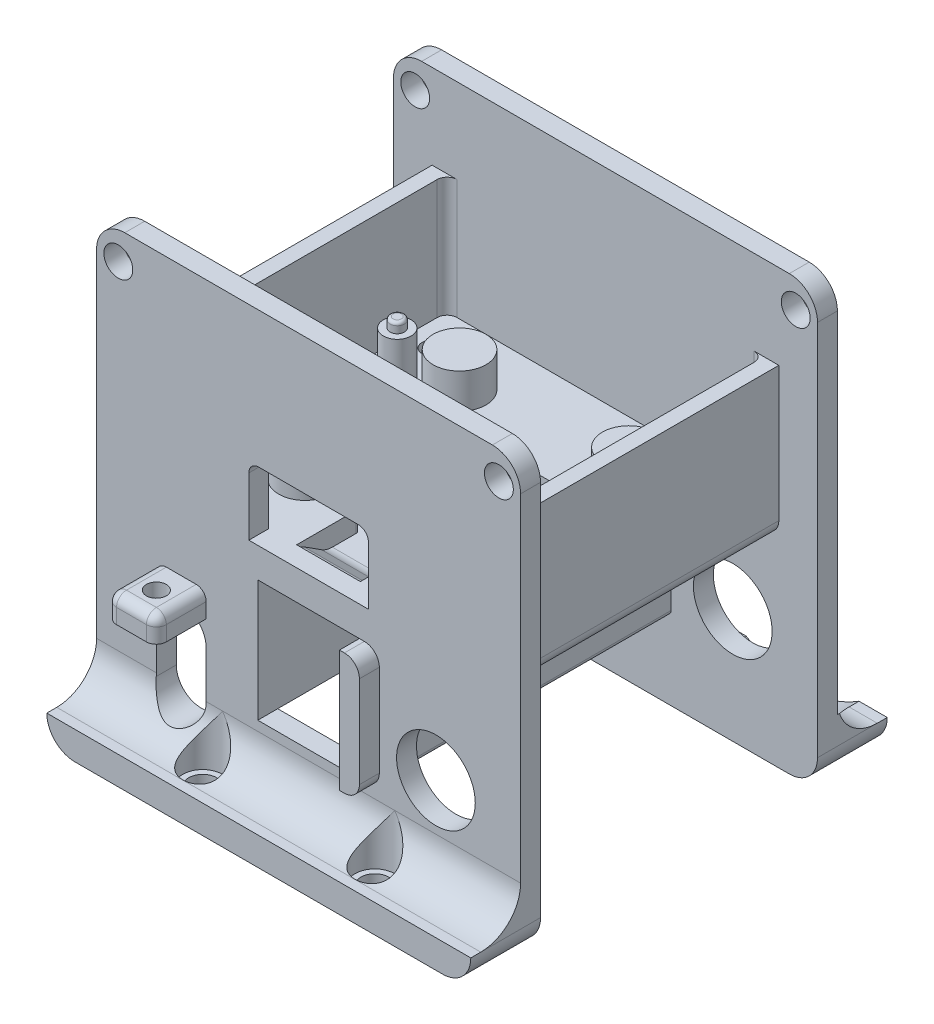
from build123d import *

# Parameters (mm, degrees)
SKETCH_1_W                = 31.8
SKETCH_1_H                = 27.8
EXTRUDE_1_DEPTH           = 3
EXTRUDE_2_DEPTH           = 1.5
SKETCH_5_R                = 1.4
EXTRUDE_3_DEPTH           = 4.5
SKETCH_6_R                = 0.725
EXTRUDE_4_DEPTH           = 1
SKETCH_7_R                = 1
CUT_EXTRUDE_1_DEPTH       = 10
SKETCH_8_R                = 2
CUT_EXTRUDE_2_DEPTH       = 1
FILLET_1_R                = 1
SKETCH_9_R                = 2.65
EXTRUDE_5_DEPTH           = 3.5
FILLET_2_R                = 0.3
CUT_EXTRUDE_8_DEPTH       = 2
CUT_EXTRUDE_9_DEPTH       = 1.5
EXTRUDE_6_DEPTH           = 6.4
FILLET_3_R                = 2
FILLET_5_R                = 1
FILLET_6_R                = 0.4
EXTRUDE_START             = -15
SKETCH_21_W               = 34.8
SKETCH_21_H               = 31.8
EXTRUDE_7_DEPTH           = 15
SKETCH_22_R               = 1.45
EXTRUDE_8_DEPTH           = 2
EXTRUDE_START_2           = -2
SKETCH_24_R               = 1.45
EXTRUDE_9_DEPTH           = 2
CUT_EXTRUDE_10_DEPTH      = 2
EXTRUDE_10_DEPTH          = 29.8
SKETCH_35_W               = 10.2
SKETCH_35_H               = 12.2
CUT_EXTRUDE_14_DEPTH      = 45.903545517
EXTRUDE_START_3           = 5
EXTRUDE_14_DEPTH          = 5
EXTRUDE_15_DEPTH          = 42.56
EXTRUDE_16_DEPTH          = 5
EXTRUDE_17_DEPTH          = 42.56
CUT_EXTRUDE_15_DEPTH      = 49.572918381
CUT_EXTRUDE_15_DEPTH_BACK = 49.572918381
SKETCH_36_R               = 3.95
SKETCH_37_W               = 5
SKETCH_37_H               = 2.5
EXTRUDE_11_DEPTH          = 5
SKETCH_38_W               = 5
SKETCH_38_H               = 2.5
EXTRUDE_12_DEPTH          = 5
FILLET_7_R                = 1
FILLET_8_R                = 1
EXTRUDE_13_DEPTH          = 2
SKETCH_49_R               = 1.4
CUT_EXTRUDE_17_DEPTH      = 6
SKETCH_51_R               = 10.376352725
CUT_EXTRUDE_18_DEPTH      = 6
SKETCH_52_R               = 1.99
CUT_EXTRUDE_19_DEPTH      = 1.5
CUT_EXTRUDE_START         = 4
SKETCH_52_2_R             = 1.99
CUT_EXTRUDE_20_DEPTH      = 4
FILLET_10_R               = 1
FILLET_12_R               = 1
SKETCH_42_R               = 1
CUT_EXTRUDE_21_DEPTH      = 4
SKETCH_54_W               = 10.2
SKETCH_54_H               = 12.2
SKETCH_54_R               = 0.8
SKETCH_54_R_2             = 1.8
EXTRUDE_18_DEPTH          = 2
FILLET_13_R               = 1.5


with BuildPart() as part:
    # Sketch 1 → Extrude 1 (new body)
    with BuildSketch(Plane(origin=(0, 0, 0), x_dir=(1, 0, 0), z_dir=(0, 1, 0))):
        Rectangle(SKETCH_1_W, SKETCH_1_H)
    extrude(amount=EXTRUDE_1_DEPTH)

    # Sketch 2 → Extrude 2 (add)
    with BuildSketch(Plane(origin=(0, 3, 0), x_dir=(1, 0, 0), z_dir=(0, 1, 0))):
        Polygon((-5.35, 5.35), (5.35, 5.35), (5.35, -7.55), (4.35, -7.55), (4.35, 4.35), (-4.35, 4.35), (-4.35, -7.55), (-5.35, -7.55), align=None)
    extrude(amount=EXTRUDE_2_DEPTH)

    # Sketch 5 → Extrude 3 (add)
    with BuildSketch(Plane(origin=(0, 3, 0), x_dir=(1, 0, 0), z_dir=(0, 1, 0))):
        with Locations(Location((12.5, 5.5, 0), (0, 0, 270))):
            Circle(SKETCH_5_R)
        with Locations(Location((12.5, -5.5, 0), (0, 0, 90))):
            Circle(SKETCH_5_R)
        with Locations(Location((-12.5, -5.5, 0), (0, 0, 270))):
            Circle(SKETCH_5_R)
        with Locations(Location((-12.5, 5.5, 0), (0, 0, 90))):
            Circle(SKETCH_5_R)
    extrude(amount=EXTRUDE_3_DEPTH)

    # Sketch 6 → Extrude 4 (add)
    with BuildSketch(Plane(origin=(0, 7.5, 0), x_dir=(1, 0, 0), z_dir=(0, 1, 0))):
        with Locations(Location((-12.5, -5.5, 0), (0, 0, 270))):
            Circle(SKETCH_6_R)
        with Locations(Location((-12.5, 5.5, 0), (0, 0, 270))):
            Circle(SKETCH_6_R)
        with Locations(Location((12.5, 5.5, 0), (0, 0, 270))):
            Circle(SKETCH_6_R)
        with Locations(Location((12.5, -5.5, 0), (0, 0, 270))):
            Circle(SKETCH_6_R)
    extrude(amount=EXTRUDE_4_DEPTH)

    # Sketch 7 → Cut-Extrude 1 (cut)
    with BuildSketch(Plane(origin=(0, 3, 0), x_dir=(1, 0, 0), z_dir=(0, 1, 0))):
        with Locations(Location((13.5, 10, 0), (0, 0, 270))):
            Circle(SKETCH_7_R)
        with Locations(Location((-13.5, 10, 0), (0, 0, 270))):
            Circle(SKETCH_7_R)
        with Locations(Location((-13.5, -10, 0), (0, 0, 270))):
            Circle(SKETCH_7_R)
        with Locations(Location((13.5, -10, 0), (0, 0, 270))):
            Circle(SKETCH_7_R)
    extrude(amount=-CUT_EXTRUDE_1_DEPTH, mode=Mode.SUBTRACT)

    # Sketch 8 → Cut-Extrude 2 (cut)
    with BuildSketch(Plane.XZ):
        with Locations(Location((-13.5, 10, 0), (0, 0, 270))):
            Circle(SKETCH_8_R)
        with Locations(Location((13.5, 10, 0), (0, 0, 270))):
            Circle(SKETCH_8_R)
        with Locations(Location((13.5, -10, 0), (0, 0, 270))):
            Circle(SKETCH_8_R)
        with Locations(Location((-13.5, -10, 0), (0, 0, 270))):
            Circle(SKETCH_8_R)
    extrude(amount=-CUT_EXTRUDE_2_DEPTH, mode=Mode.SUBTRACT)

    # Fillet 1
    fillet_1_edges = [part.edges().sort_by_distance(p)[0] for p in [
        (15.9, 1.5, 13.9),
        (-15.9, 1.5, 13.9),
        (-15.9, 1.5, -13.9),
        (15.9, 1.5, -13.9),
    ]]
    fillet(fillet_1_edges, radius=FILLET_1_R)

    # Sketch 9 → Extrude 5 (add)
    with BuildSketch(Plane(origin=(0, 3, 0), x_dir=(1, 0, 0), z_dir=(0, 1, 0))):
        with Locations(Location((8.5, 7.75, 0), (0, 0, 270))):
            Circle(SKETCH_9_R)
        with Locations(Location((-8.5, 7.75, 0), (0, 0, 90))):
            Circle(SKETCH_9_R)
        with Locations(Location((-8.5, -7.75, 0), (0, 0, 270))):
            Circle(SKETCH_9_R)
        with Locations(Location((8.5, -7.75, 0), (0, 0, 90))):
            Circle(SKETCH_9_R)
    extrude(amount=EXTRUDE_5_DEPTH)

    # Fillet 2
    fillet_2_edges = [part.edges().sort_by_distance(p)[0] for p in [
        (-12.5, 8.5, 4.775),
        (-12.5, 8.5, -6.225),
        (12.5, 8.5, -6.225),
        (12.5, 8.5, 4.775),
    ]]
    fillet(fillet_2_edges, radius=FILLET_2_R)

    # Sketch 15 → Cut-Extrude 8 (cut)
    with BuildSketch(Plane(origin=(0, 3, 0), x_dir=(1, 0, 0), z_dir=(0, 1, 0))):
        Polygon((-4.35, 4.35), (4.35, 4.35), (4.35, -7.55), (3.2, -7.55), (3.2, -13.9), (-3.2, -13.9), (-3.2, -7.55), (-4.35, -7.55), align=None)
    extrude(amount=-CUT_EXTRUDE_8_DEPTH, mode=Mode.SUBTRACT)

    # Sketch 17 → Cut-Extrude 9 (cut)
    with BuildSketch(Plane(origin=(0, 4.5, 0), x_dir=(1, 0, 0), z_dir=(0, 1, 0))):
        Polygon((-4.35, -7.55), (-4.35, 4.35), (4.35, 4.35), (4.35, -7.55), (5.35, -7.55), (5.35, 5.35), (-5.35, 5.35), (-5.35, -7.55), align=None)
    extrude(amount=-CUT_EXTRUDE_9_DEPTH, mode=Mode.SUBTRACT)

    # Sketch 18 → Extrude 6 (add)
    with BuildSketch(Plane.ZY.offset(-3.2)):
        Polygon((13.9, 1), (10.9, 1), (13.4, 2.6), (13.9, 2.6), align=None)
    extrude(amount=EXTRUDE_6_DEPTH)

    # Fillet 3
    fillet_3_edges = [part.edges().sort_by_distance(p)[0] for p in [
        (0, 1, 10.9),
    ]]
    fillet(fillet_3_edges, radius=FILLET_3_R)

    # Fillet 5
    fillet_5_edges = [part.edges().sort_by_distance(p)[0] for p in [
        (0, 2.6, 13.4),
    ]]
    fillet(fillet_5_edges, radius=FILLET_5_R)

    # Fillet 6
    fillet_6_edges = [part.edges().sort_by_distance(p)[0] for p in [
        (3.2, 2, 7.55),
        (-3.2, 2, 7.55),
    ]]
    fillet(fillet_6_edges, radius=FILLET_6_R)

    # Sketch 21 → Extrude 7 (add)
    with BuildSketch(Plane.XZ.offset(EXTRUDE_START)):
        Rectangle(SKETCH_21_W, SKETCH_21_H)
        with BuildLine():
            Line((-14.9, 13.9), (14.9, 13.9))
            ThreePointArc((14.9, 13.9), (15.607106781, 13.607106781), (15.9, 12.9))
            Line((15.9, 12.9), (15.9, -12.9))
            ThreePointArc((15.9, -12.9), (15.607106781, -13.607106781), (14.9, -13.9))
            Line((14.9, -13.9), (-14.9, -13.9))
            ThreePointArc((-14.9, -13.9), (-15.607106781, -13.607106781), (-15.9, -12.9))
            Line((-15.9, -12.9), (-15.9, 12.9))
            ThreePointArc((-15.9, 12.9), (-15.607106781, 13.607106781), (-14.9, 13.9))
        make_face(mode=Mode.SUBTRACT)
    extrude(amount=EXTRUDE_7_DEPTH)

    # Sketch 22 → Extrude 8 (add)
    with BuildSketch(Plane.XY.offset(15.9)):
        with BuildLine():
            Line((-21.28, 0), (-21.28, 20.67))
            ThreePointArc((-21.28, 20.67), (-20.451112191, 22.671112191), (-18.45, 23.5))
            Line((-18.45, 23.5), (18.45, 23.5))
            ThreePointArc((18.45, 23.5), (20.451112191, 22.671112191), (21.28, 20.67))
            Line((21.28, 20.67), (21.28, 0))
            Line((21.28, 0), (21.28, -17.17))
            ThreePointArc((21.28, -17.17), (20.451112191, -19.171112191), (18.45, -20))
            Line((18.45, -20), (-18.45, -20))
            ThreePointArc((-18.45, -20), (-20.451112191, -19.171112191), (-21.28, -17.17))
            Line((-21.28, -17.17), (-21.28, 0))
        make_face()
        with Locations((-19.1, 20.67)):
            Circle(SKETCH_22_R, mode=Mode.SUBTRACT)
        with Locations((19.1, 20.67)):
            Circle(SKETCH_22_R, mode=Mode.SUBTRACT)
    extrude(amount=-EXTRUDE_8_DEPTH)

    # Sketch 24 → Extrude 9 (add)
    with BuildSketch(Plane(origin=(0, 0, -15.9), x_dir=(-1, 0, 0), z_dir=(0, 0, -1)).offset(EXTRUDE_START_2)):
        with BuildLine():
            Line((-18.45, -20), (18.45, -20))
            ThreePointArc((18.45, -20), (20.451112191, -19.171112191), (21.28, -17.17))
            Line((21.28, -17.17), (21.28, 20.67))
            ThreePointArc((21.28, 20.67), (20.451112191, 22.671112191), (18.45, 23.5))
            Line((18.45, 23.5), (-18.45, 23.5))
            ThreePointArc((-18.45, 23.5), (-20.451112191, 22.671112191), (-21.28, 20.67))
            Line((-21.28, 20.67), (-21.28, -17.17))
            ThreePointArc((-21.28, -17.17), (-20.451112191, -19.171112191), (-18.45, -20))
        make_face()
        with Locations(Location((-19.1, 20.67, 0), (0, 0, 180))):
            Circle(SKETCH_24_R, mode=Mode.SUBTRACT)
        with Locations(Location((19.1, 20.67, 0), (0, 0, 180))):
            Circle(SKETCH_24_R, mode=Mode.SUBTRACT)
    extrude(amount=EXTRUDE_9_DEPTH)

    # Sketch 25 → Cut-Extrude 10 (cut)
    with BuildSketch(Plane.XY.offset(15.9)):
        with BuildLine():
            Line((-5, 9.85), (5, 9.85))
            ThreePointArc((5, 9.85), (5.707106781, 9.557106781), (6, 8.85))
            Line((6, 8.85), (6, 3))
            Line((6, 3), (-6, 3))
            Line((-6, 3), (-6, 8.85))
            ThreePointArc((-6, 8.85), (-5.707106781, 9.557106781), (-5, 9.85))
        make_face()
    extrude(amount=-CUT_EXTRUDE_10_DEPTH, mode=Mode.SUBTRACT)

    # Sketch 27 → Extrude 10 (add)
    with BuildSketch(Plane.XY.offset(15.9)):
        with BuildLine():
            Line((-5.1, 0), (-5.1, -12.2))
            Line((-5.1, -12.2), (-6.1, -12.2))
            ThreePointArc((-6.1, -12.2), (-6.453553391, -12.053553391), (-6.6, -11.7))
            Line((-6.6, -11.7), (-6.6, 0))
            Line((-6.6, 0), (-5.1, 0))
        make_face()
        with BuildLine():
            Line((5.1, 0), (5.1, -12.2))
            Line((5.1, -12.2), (6.1, -12.2))
            ThreePointArc((6.1, -12.2), (6.453553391, -12.053553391), (6.6, -11.7))
            Line((6.6, -11.7), (6.6, 0))
            Line((6.6, 0), (5.1, 0))
        make_face()
    extrude(amount=-EXTRUDE_10_DEPTH)

    # Sketch 35 → Cut-Extrude 14 (cut, through all)
    with BuildSketch(Plane.XY.offset(15.9)):
        with Locations((0, -6.1)):
            Rectangle(SKETCH_35_W, SKETCH_35_H)
    extrude(amount=-CUT_EXTRUDE_14_DEPTH, mode=Mode.SUBTRACT)

    # Sketch 43 → Extrude 14 (add)
    with BuildSketch(Plane.XY.offset(15.9).offset(EXTRUDE_START_3)):
        with BuildLine():
            Line((-21.28, -17.17), (21.28, -17.17))
            ThreePointArc((21.28, -17.17), (20.451112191, -19.171112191), (18.45, -20))
            Line((18.45, -20), (-18.45, -20))
            ThreePointArc((-18.45, -20), (-20.451112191, -19.171112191), (-21.28, -17.17))
        make_face()
    extrude(amount=-EXTRUDE_14_DEPTH)

    # Sketch 44 → Extrude 15 (add)
    with BuildSketch(Plane.ZY.offset(21.28)):
        with BuildLine():
            Line((15.9, -13.17), (15.9, -17.17))
            Line((15.9, -17.17), (19.9, -17.17))
            ThreePointArc((19.9, -17.17), (17.071572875, -15.998427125), (15.9, -13.17))
        make_face()
    extrude(amount=-EXTRUDE_15_DEPTH)

    # Sketch 45 → Extrude 16 (add)
    with BuildSketch(Plane(origin=(0, 0, -15.9), x_dir=(-1, 0, 0), z_dir=(0, 0, -1))):
        with BuildLine():
            Line((-18.45, -20), (18.45, -20))
            ThreePointArc((18.45, -20), (20.451112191, -19.171112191), (21.28, -17.17))
            Line((21.28, -17.17), (-21.28, -17.17))
            ThreePointArc((-21.28, -17.17), (-20.451112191, -19.171112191), (-18.45, -20))
        make_face()
    extrude(amount=EXTRUDE_16_DEPTH)

    # Sketch 46 → Extrude 17 (add)
    with BuildSketch(Plane(origin=(21.28, 0, 0), x_dir=(0, 0, -1), z_dir=(1, 0, 0))):
        with BuildLine():
            Line((15.9, -13.17), (15.9, -17.17))
            Line((15.9, -17.17), (19.9, -17.17))
            ThreePointArc((19.9, -17.17), (17.071572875, -15.998427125), (15.9, -13.17))
        make_face()
    extrude(amount=-EXTRUDE_17_DEPTH)

    # Sketch 36 → Cut-Extrude 15 (cut, two sides: drawn at the far end of the back side and taken through both)
    with BuildSketch(Plane.XY.offset(15.9).offset(-CUT_EXTRUDE_15_DEPTH_BACK)):
        with Locations((12.78, -8.481512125)):
            Circle(SKETCH_36_R)
        with BuildLine():
            Line((-15.28, -8.481512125), (-15.28, -13.481512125))
            ThreePointArc((-15.28, -13.481512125), (-12.78, -15.981512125), (-10.28, -13.481512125))
            Line((-10.28, -13.481512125), (-10.28, -8.481512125))
            ThreePointArc((-10.28, -8.481512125), (-12.78, -5.981512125), (-15.28, -8.481512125))
        make_face()
    extrude(amount=CUT_EXTRUDE_15_DEPTH + CUT_EXTRUDE_15_DEPTH_BACK, mode=Mode.SUBTRACT)

    # Sketch 37 → Extrude 11 (add)
    with BuildSketch(Plane.XY.offset(15.9)):
        with Locations((-12.78, -4.731512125)):
            Rectangle(SKETCH_37_W, SKETCH_37_H)
    extrude(amount=EXTRUDE_11_DEPTH)

    # Sketch 38 → Extrude 12 (add)
    with BuildSketch(Plane(origin=(0, 0, -15.9), x_dir=(-1, 0, 0), z_dir=(0, 0, -1))):
        with Locations((12.78, -4.731512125)):
            Rectangle(SKETCH_38_W, SKETCH_38_H)
    extrude(amount=EXTRUDE_12_DEPTH)

    # Fillet 7
    fillet_7_edges = [part.edges().sort_by_distance(p)[0] for p in [
        (-15.28, -4.731512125, 20.9),
        (-10.28, -4.731512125, 20.9),
    ]]
    fillet(fillet_7_edges, radius=FILLET_7_R)

    # Fillet 8
    fillet_8_edges = [part.edges().sort_by_distance(p)[0] for p in [
        (-10.28, -4.731512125, -20.9),
        (-15.28, -4.731512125, -20.9),
    ]]
    fillet(fillet_8_edges, radius=FILLET_8_R)

    # Sketch 41 → Extrude 13 (add)
    with BuildSketch(Plane.XY.offset(15.9)):
        with BuildLine():
            Line((5.1, 0), (5.6, 0))
            ThreePointArc((5.6, 0), (6.660660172, -0.439339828), (7.1, -1.5))
            Line((7.1, -1.5), (7.1, -10.7))
            ThreePointArc((7.1, -10.7), (6.660660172, -11.760660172), (5.6, -12.2))
            Line((5.6, -12.2), (5.1, -12.2))
            Line((5.1, -12.2), (5.1, 0))
        make_face()
    extrude(amount=EXTRUDE_13_DEPTH)

    # Sketch 49 → Cut-Extrude 17 (cut)
    with BuildSketch(Plane.XZ.offset(20)):
        with Locations((-8.64, 17.89)):
            Circle(SKETCH_49_R)
        with Locations((8.64, 17.89)):
            Circle(SKETCH_49_R)
        with Locations((8.64, -17.89)):
            Circle(SKETCH_49_R)
        with Locations((-8.64, -17.89)):
            Circle(SKETCH_49_R)
    extrude(amount=-CUT_EXTRUDE_17_DEPTH, mode=Mode.SUBTRACT)

    # Sketch 51 → Cut-Extrude 18 (cut)
    with BuildSketch(Plane(origin=(0, 0, -15.9), x_dir=(-1, 0, 0), z_dir=(0, 0, -1))):
        with Locations((-12.78, -8.481512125)):
            Circle(SKETCH_51_R)
    extrude(amount=CUT_EXTRUDE_18_DEPTH, mode=Mode.SUBTRACT)

    # Sketch 52 → Cut-Extrude 19 (cut)
    with BuildSketch(Plane(origin=(0, -17.17, 0), x_dir=(1, 0, 0), z_dir=(0, 1, 0))):
        with Locations(Location((-8.64, -17.89, 0), (0, 0, 180))):
            Circle(SKETCH_52_R)
        with Locations(Location((-8.64, 17.89, 0), (0, 0, 180))):
            Circle(SKETCH_52_R)
        with Locations(Location((8.64, 17.89, 0), (0, 0, 180))):
            Circle(SKETCH_52_R)
        with Locations(Location((8.64, -17.89, 0), (0, 0, 180))):
            Circle(SKETCH_52_R)
    extrude(amount=-CUT_EXTRUDE_19_DEPTH, mode=Mode.SUBTRACT)

    # Sketch 52_2 → Cut-Extrude 20 (cut)
    with BuildSketch(Plane(origin=(0, -17.17, 0), x_dir=(1, 0, 0), z_dir=(0, 1, 0)).offset(CUT_EXTRUDE_START)):
        with Locations(Location((-8.64, -17.89, 0), (0, 0, 180))):
            Circle(SKETCH_52_2_R)
        with Locations(Location((-8.64, 17.89, 0), (0, 0, 180))):
            Circle(SKETCH_52_2_R)
        with Locations(Location((8.64, 17.89, 0), (0, 0, 180))):
            Circle(SKETCH_52_2_R)
        with Locations(Location((8.64, -17.89, 0), (0, 0, 180))):
            Circle(SKETCH_52_2_R)
    extrude(amount=-CUT_EXTRUDE_20_DEPTH, mode=Mode.SUBTRACT)

    # Fillet 10
    fillet_10_edges = [part.edges().sort_by_distance(p)[0] for p in [
        (-12.78, -3.481512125, 20.9),
        (-15.28, -3.481512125, 17.9),
        (-10.28, -3.481512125, 17.9),
        (-14.987106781, -3.481512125, 20.607106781),
        (-10.572893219, -3.481512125, 20.607106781),
    ]]
    fillet(fillet_10_edges, radius=FILLET_10_R)

    # Fillet 12
    fillet_12_edges = [part.edges().sort_by_distance(p)[0] for p in [
        (-12.78, -3.481512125, -20.9),
        (-10.28, -3.481512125, -17.9),
        (-15.28, -3.481512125, -17.9),
        (-14.987106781, -3.481512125, -20.607106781),
        (-10.572893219, -3.481512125, -20.607106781),
    ]]
    fillet(fillet_12_edges, radius=FILLET_12_R)

    # Sketch 42 → Cut-Extrude 21 (cut)
    with BuildSketch(Plane(origin=(0, -3.481512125, 0), x_dir=(1, 0, 0), z_dir=(0, 1, 0))):
        with Locations(Location((-12.78, -18.4, 0), (0, 0, 270))):
            Circle(SKETCH_42_R)
        with Locations(Location((-12.78, 18.4, 0), (0, 0, 270))):
            Circle(SKETCH_42_R)
    extrude(amount=-CUT_EXTRUDE_21_DEPTH, mode=Mode.SUBTRACT)

    # Sketch 54 → Extrude 18 (add)
    with BuildSketch(Plane(origin=(0, 0, -6.3), x_dir=(-1, 0, 0), z_dir=(0, 0, -1))):
        with Locations((0, -6.1)):
            Rectangle(SKETCH_54_W, SKETCH_54_H)
        with Locations((0, -1.6)):
            Circle(SKETCH_54_R, mode=Mode.SUBTRACT)
        with Locations((0, -10.6)):
            Circle(SKETCH_54_R, mode=Mode.SUBTRACT)
        with Locations((0, -6.1)):
            Circle(SKETCH_54_R_2, mode=Mode.SUBTRACT)
    extrude(amount=EXTRUDE_18_DEPTH)

    # Fillet 13
    fillet_13_edges = [part.edges().sort_by_distance(p)[0] for p in [
        (-17.4, 0, 0),
        (17.4, 0, 0),
    ]]
    fillet(fillet_13_edges, radius=FILLET_13_R)


solid = part.part
